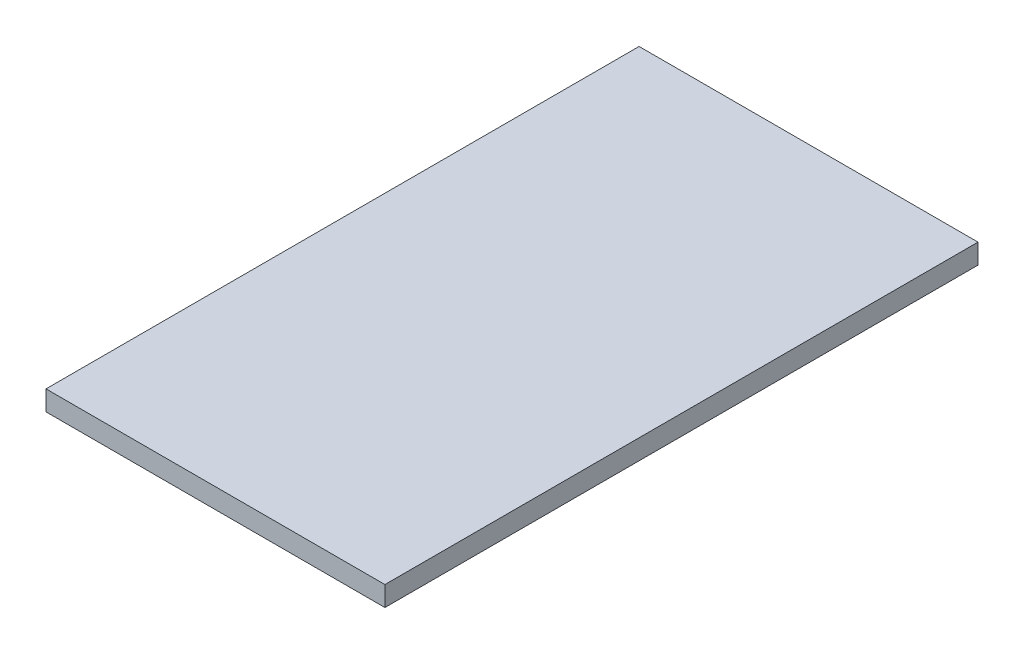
ISO-10303-21;
HEADER;
FILE_DESCRIPTION(('STEP AP214'),'2;1');
FILE_NAME('part.step','',(''),(''),'','','');
FILE_SCHEMA(('AUTOMOTIVE_DESIGN { 1 0 10303 214 1 1 1 1 }'));
ENDSEC;
DATA;
#1=APPLICATION_CONTEXT('core data for automotive mechanical design processes');
#2=APPLICATION_PROTOCOL_DEFINITION('international standard','automotive_design',2000,#1);
#3=PRODUCT_CONTEXT('',#1,'mechanical');
#4=PRODUCT('Part','Part','',(#3));
#5=PRODUCT_RELATED_PRODUCT_CATEGORY('part','',(#4));
#6=PRODUCT_DEFINITION_FORMATION('','',#4);
#7=PRODUCT_DEFINITION_CONTEXT('part definition',#1,'design');
#8=PRODUCT_DEFINITION('design','',#6,#7);
#9=PRODUCT_DEFINITION_SHAPE('','',#8);
#10=(LENGTH_UNIT() NAMED_UNIT(*) SI_UNIT(.MILLI.,.METRE.));
#11=(NAMED_UNIT(*) PLANE_ANGLE_UNIT() SI_UNIT($,.RADIAN.));
#12=(NAMED_UNIT(*) SI_UNIT($,.STERADIAN.) SOLID_ANGLE_UNIT());
#13=UNCERTAINTY_MEASURE_WITH_UNIT(LENGTH_MEASURE(1.E-05),#10,'distance_accuracy_value','');
#14=(GEOMETRIC_REPRESENTATION_CONTEXT(3) GLOBAL_UNCERTAINTY_ASSIGNED_CONTEXT((#13)) GLOBAL_UNIT_ASSIGNED_CONTEXT((#10,
#11,#12)) REPRESENTATION_CONTEXT('',''));
#15=CARTESIAN_POINT('',(0.,0.,0.));
#16=DIRECTION('',(0.,0.,1.));
#17=DIRECTION('',(1.,0.,0.));
#18=AXIS2_PLACEMENT_3D('',#15,#16,#17);
#19=CARTESIAN_POINT('',(340.,40.,595.));
#20=DIRECTION('',(-1.,0.,0.));
#21=DIRECTION('',(0.,0.,1.));
#22=AXIS2_PLACEMENT_3D('',#19,#20,#21);
#23=PLANE('',#22);
#24=DIRECTION('',(0.,0.,-1.));
#25=VECTOR('',#24,1.);
#26=CARTESIAN_POINT('',(340.,0.,595.));
#27=LINE('',#26,#25);
#28=CARTESIAN_POINT('',(340.,0.,595.));
#29=VERTEX_POINT('',#28);
#30=CARTESIAN_POINT('',(340.,0.,-595.));
#31=VERTEX_POINT('',#30);
#32=EDGE_CURVE('E109',#29,#31,#27,.T.);
#33=ORIENTED_EDGE('',*,*,#32,.T.);
#34=DIRECTION('',(0.,-1.,0.));
#35=VECTOR('',#34,1.);
#36=CARTESIAN_POINT('',(340.,40.,-595.));
#37=LINE('',#36,#35);
#38=CARTESIAN_POINT('',(340.,40.,-595.));
#39=VERTEX_POINT('',#38);
#40=EDGE_CURVE('E11',#39,#31,#37,.T.);
#41=ORIENTED_EDGE('',*,*,#40,.F.);
#42=DIRECTION('',(0.,0.,-1.));
#43=VECTOR('',#42,1.);
#44=CARTESIAN_POINT('',(340.,40.,595.));
#45=LINE('',#44,#43);
#46=CARTESIAN_POINT('',(340.,40.,595.));
#47=VERTEX_POINT('',#46);
#48=EDGE_CURVE('E93',#47,#39,#45,.T.);
#49=ORIENTED_EDGE('',*,*,#48,.F.);
#50=DIRECTION('',(0.,-1.,0.));
#51=VECTOR('',#50,1.);
#52=CARTESIAN_POINT('',(340.,40.,595.));
#53=LINE('',#52,#51);
#54=EDGE_CURVE('E105',#47,#29,#53,.T.);
#55=ORIENTED_EDGE('',*,*,#54,.T.);
#56=EDGE_LOOP('',(#33,#41,#49,#55));
#57=FACE_BOUND('',#56,.T.);
#58=ADVANCED_FACE('F41',(#57),#23,.F.);
#59=CARTESIAN_POINT('',(-340.,40.,-595.));
#60=DIRECTION('',(0.,0.,1.));
#61=DIRECTION('',(1.,0.,0.));
#62=AXIS2_PLACEMENT_3D('',#59,#60,#61);
#63=PLANE('',#62);
#64=DIRECTION('',(-1.,0.,0.));
#65=VECTOR('',#64,1.);
#66=CARTESIAN_POINT('',(-340.,0.,-595.));
#67=LINE('',#66,#65);
#68=CARTESIAN_POINT('',(-340.,0.,-595.));
#69=VERTEX_POINT('',#68);
#70=EDGE_CURVE('E98',#31,#69,#67,.T.);
#71=ORIENTED_EDGE('',*,*,#70,.T.);
#72=DIRECTION('',(0.,-1.,0.));
#73=VECTOR('',#72,1.);
#74=CARTESIAN_POINT('',(-340.,40.,-595.));
#75=LINE('',#74,#73);
#76=CARTESIAN_POINT('',(-340.,40.,-595.));
#77=VERTEX_POINT('',#76);
#78=EDGE_CURVE('E50',#77,#69,#75,.T.);
#79=ORIENTED_EDGE('',*,*,#78,.F.);
#80=DIRECTION('',(-1.,0.,0.));
#81=VECTOR('',#80,1.);
#82=CARTESIAN_POINT('',(-340.,40.,-595.));
#83=LINE('',#82,#81);
#84=EDGE_CURVE('E88',#39,#77,#83,.T.);
#85=ORIENTED_EDGE('',*,*,#84,.F.);
#86=ORIENTED_EDGE('',*,*,#40,.T.);
#87=EDGE_LOOP('',(#71,#79,#85,#86));
#88=FACE_BOUND('',#87,.T.);
#89=ADVANCED_FACE('F97',(#88),#63,.F.);
#90=CARTESIAN_POINT('',(-340.,40.,595.));
#91=DIRECTION('',(1.,0.,0.));
#92=DIRECTION('',(0.,0.,-1.));
#93=AXIS2_PLACEMENT_3D('',#90,#91,#92);
#94=PLANE('',#93);
#95=DIRECTION('',(0.,0.,1.));
#96=VECTOR('',#95,1.);
#97=CARTESIAN_POINT('',(-340.,0.,595.));
#98=LINE('',#97,#96);
#99=CARTESIAN_POINT('',(-340.,0.,595.));
#100=VERTEX_POINT('',#99);
#101=EDGE_CURVE('E75',#69,#100,#98,.T.);
#102=ORIENTED_EDGE('',*,*,#101,.T.);
#103=DIRECTION('',(0.,-1.,0.));
#104=VECTOR('',#103,1.);
#105=CARTESIAN_POINT('',(-340.,40.,595.));
#106=LINE('',#105,#104);
#107=CARTESIAN_POINT('',(-340.,40.,595.));
#108=VERTEX_POINT('',#107);
#109=EDGE_CURVE('E100',#108,#100,#106,.T.);
#110=ORIENTED_EDGE('',*,*,#109,.F.);
#111=DIRECTION('',(0.,0.,1.));
#112=VECTOR('',#111,1.);
#113=CARTESIAN_POINT('',(-340.,40.,595.));
#114=LINE('',#113,#112);
#115=EDGE_CURVE('E91',#77,#108,#114,.T.);
#116=ORIENTED_EDGE('',*,*,#115,.F.);
#117=ORIENTED_EDGE('',*,*,#78,.T.);
#118=EDGE_LOOP('',(#102,#110,#116,#117));
#119=FACE_BOUND('',#118,.T.);
#120=ADVANCED_FACE('F101',(#119),#94,.F.);
#121=CARTESIAN_POINT('',(-340.,40.,595.));
#122=DIRECTION('',(0.,0.,-1.));
#123=DIRECTION('',(-1.,0.,0.));
#124=AXIS2_PLACEMENT_3D('',#121,#122,#123);
#125=PLANE('',#124);
#126=DIRECTION('',(1.,0.,0.));
#127=VECTOR('',#126,1.);
#128=CARTESIAN_POINT('',(-340.,0.,595.));
#129=LINE('',#128,#127);
#130=EDGE_CURVE('E81',#100,#29,#129,.T.);
#131=ORIENTED_EDGE('',*,*,#130,.T.);
#132=ORIENTED_EDGE('',*,*,#54,.F.);
#133=DIRECTION('',(1.,0.,0.));
#134=VECTOR('',#133,1.);
#135=CARTESIAN_POINT('',(-340.,40.,595.));
#136=LINE('',#135,#134);
#137=EDGE_CURVE('E58',#108,#47,#136,.T.);
#138=ORIENTED_EDGE('',*,*,#137,.F.);
#139=ORIENTED_EDGE('',*,*,#109,.T.);
#140=EDGE_LOOP('',(#131,#132,#138,#139));
#141=FACE_BOUND('',#140,.T.);
#142=ADVANCED_FACE('F122',(#141),#125,.F.);
#143=CARTESIAN_POINT('',(0.,40.,0.));
#144=DIRECTION('',(0.,-1.,0.));
#145=DIRECTION('',(0.,0.,-1.));
#146=AXIS2_PLACEMENT_3D('',#143,#144,#145);
#147=PLANE('',#146);
#148=ORIENTED_EDGE('',*,*,#48,.T.);
#149=ORIENTED_EDGE('',*,*,#84,.T.);
#150=ORIENTED_EDGE('',*,*,#115,.T.);
#151=ORIENTED_EDGE('',*,*,#137,.T.);
#152=EDGE_LOOP('',(#148,#149,#150,#151));
#153=FACE_BOUND('',#152,.T.);
#154=ADVANCED_FACE('F89',(#153),#147,.F.);
#155=CARTESIAN_POINT('',(0.,0.,0.));
#156=DIRECTION('',(0.,-1.,0.));
#157=DIRECTION('',(0.,0.,-1.));
#158=AXIS2_PLACEMENT_3D('',#155,#156,#157);
#159=PLANE('',#158);
#160=ORIENTED_EDGE('',*,*,#32,.F.);
#161=ORIENTED_EDGE('',*,*,#130,.F.);
#162=ORIENTED_EDGE('',*,*,#101,.F.);
#163=ORIENTED_EDGE('',*,*,#70,.F.);
#164=EDGE_LOOP('',(#160,#161,#162,#163));
#165=FACE_BOUND('',#164,.T.);
#166=ADVANCED_FACE('F125',(#165),#159,.T.);
#167=CLOSED_SHELL('',(#58,#89,#120,#142,#154,#166));
#168=MANIFOLD_SOLID_BREP('B2',#167);
#169=ADVANCED_BREP_SHAPE_REPRESENTATION('',(#18,#168),#14);
#170=SHAPE_DEFINITION_REPRESENTATION(#9,#169);
ENDSEC;
END-ISO-10303-21;
